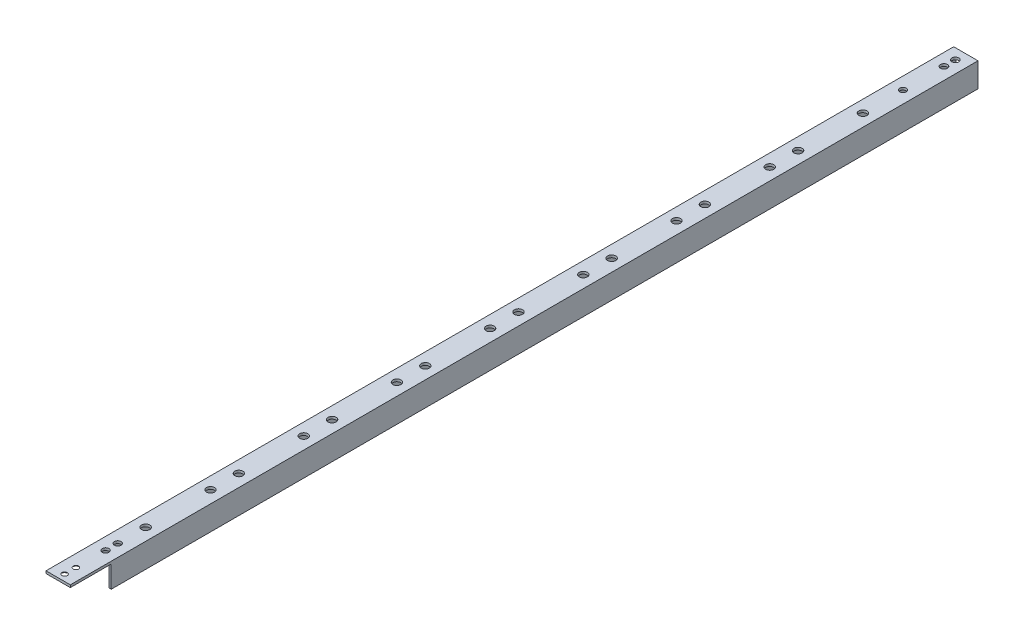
ISO-10303-21;
HEADER;
FILE_DESCRIPTION(('STEP AP214'),'2;1');
FILE_NAME('part.step','',(''),(''),'','','');
FILE_SCHEMA(('AUTOMOTIVE_DESIGN { 1 0 10303 214 1 1 1 1 }'));
ENDSEC;
DATA;
#1=APPLICATION_CONTEXT('core data for automotive mechanical design processes');
#2=APPLICATION_PROTOCOL_DEFINITION('international standard','automotive_design',2000,#1);
#3=PRODUCT_CONTEXT('',#1,'mechanical');
#4=PRODUCT('Part','Part','',(#3));
#5=PRODUCT_RELATED_PRODUCT_CATEGORY('part','',(#4));
#6=PRODUCT_DEFINITION_FORMATION('','',#4);
#7=PRODUCT_DEFINITION_CONTEXT('part definition',#1,'design');
#8=PRODUCT_DEFINITION('design','',#6,#7);
#9=PRODUCT_DEFINITION_SHAPE('','',#8);
#10=(LENGTH_UNIT() NAMED_UNIT(*) SI_UNIT(.MILLI.,.METRE.));
#11=(NAMED_UNIT(*) PLANE_ANGLE_UNIT() SI_UNIT($,.RADIAN.));
#12=(NAMED_UNIT(*) SI_UNIT($,.STERADIAN.) SOLID_ANGLE_UNIT());
#13=UNCERTAINTY_MEASURE_WITH_UNIT(LENGTH_MEASURE(1.E-05),#10,'distance_accuracy_value','');
#14=(GEOMETRIC_REPRESENTATION_CONTEXT(3) GLOBAL_UNCERTAINTY_ASSIGNED_CONTEXT((#13)) GLOBAL_UNIT_ASSIGNED_CONTEXT((#10,
#11,#12)) REPRESENTATION_CONTEXT('',''));
#15=CARTESIAN_POINT('',(0.,0.,0.));
#16=DIRECTION('',(0.,0.,1.));
#17=DIRECTION('',(1.,0.,0.));
#18=AXIS2_PLACEMENT_3D('',#15,#16,#17);
#19=CARTESIAN_POINT('',(-15.,-15.,560.));
#20=DIRECTION('',(0.,1.,0.));
#21=DIRECTION('',(0.,0.,1.));
#22=AXIS2_PLACEMENT_3D('',#19,#20,#21);
#23=PLANE('',#22);
#24=DIRECTION('',(1.,0.,0.));
#25=VECTOR('',#24,1.);
#26=CARTESIAN_POINT('',(0.,-15.,509.5));
#27=LINE('',#26,#25);
#28=CARTESIAN_POINT('',(12.,-15.,509.5));
#29=VERTEX_POINT('',#28);
#30=CARTESIAN_POINT('',(15.,-15.,509.5));
#31=VERTEX_POINT('',#30);
#32=EDGE_CURVE('E144',#29,#31,#27,.T.);
#33=ORIENTED_EDGE('',*,*,#32,.F.);
#34=DIRECTION('',(0.,0.,1.));
#35=VECTOR('',#34,1.);
#36=CARTESIAN_POINT('',(12.,-15.,-560.));
#37=LINE('',#36,#35);
#38=CARTESIAN_POINT('',(12.,-15.,-560.));
#39=VERTEX_POINT('',#38);
#40=EDGE_CURVE('E264',#39,#29,#37,.T.);
#41=ORIENTED_EDGE('',*,*,#40,.F.);
#42=DIRECTION('',(1.,0.,0.));
#43=VECTOR('',#42,1.);
#44=CARTESIAN_POINT('',(-15.,-15.,-560.));
#45=LINE('',#44,#43);
#46=CARTESIAN_POINT('',(15.,-15.,-560.));
#47=VERTEX_POINT('',#46);
#48=EDGE_CURVE('E289',#39,#47,#45,.T.);
#49=ORIENTED_EDGE('',*,*,#48,.T.);
#50=DIRECTION('',(0.,0.,-1.));
#51=VECTOR('',#50,1.);
#52=CARTESIAN_POINT('',(15.,-15.,560.));
#53=LINE('',#52,#51);
#54=EDGE_CURVE('E282',#31,#47,#53,.T.);
#55=ORIENTED_EDGE('',*,*,#54,.F.);
#56=EDGE_LOOP('',(#33,#41,#49,#55));
#57=FACE_BOUND('',#56,.T.);
#58=ADVANCED_FACE('F34',(#57),#23,.F.);
#59=DIRECTION('',(1.,0.,0.));
#60=VECTOR('',#59,1.);
#61=CARTESIAN_POINT('',(0.,-15.,509.5));
#62=LINE('',#61,#60);
#63=CARTESIAN_POINT('',(-15.,-15.,509.5));
#64=VERTEX_POINT('',#63);
#65=CARTESIAN_POINT('',(-12.,-15.,509.5));
#66=VERTEX_POINT('',#65);
#67=EDGE_CURVE('E122',#64,#66,#62,.T.);
#68=ORIENTED_EDGE('',*,*,#67,.F.);
#69=DIRECTION('',(0.,0.,-1.));
#70=VECTOR('',#69,1.);
#71=CARTESIAN_POINT('',(-15.,-15.,560.));
#72=LINE('',#71,#70);
#73=CARTESIAN_POINT('',(-15.,-15.,-560.));
#74=VERTEX_POINT('',#73);
#75=EDGE_CURVE('E131',#64,#74,#72,.T.);
#76=ORIENTED_EDGE('',*,*,#75,.T.);
#77=CARTESIAN_POINT('',(-12.,-15.,-560.));
#78=VERTEX_POINT('',#77);
#79=EDGE_CURVE('E278',#74,#78,#45,.T.);
#80=ORIENTED_EDGE('',*,*,#79,.T.);
#81=DIRECTION('',(0.,0.,1.));
#82=VECTOR('',#81,1.);
#83=CARTESIAN_POINT('',(-12.,-15.,-560.));
#84=LINE('',#83,#82);
#85=EDGE_CURVE('E268',#78,#66,#84,.T.);
#86=ORIENTED_EDGE('',*,*,#85,.T.);
#87=EDGE_LOOP('',(#68,#76,#80,#86));
#88=FACE_BOUND('',#87,.T.);
#89=ADVANCED_FACE('F303',(#88),#23,.F.);
#90=CARTESIAN_POINT('',(12.,-15.,-560.));
#91=DIRECTION('',(1.,0.,0.));
#92=DIRECTION('',(0.,0.,-1.));
#93=AXIS2_PLACEMENT_3D('',#90,#91,#92);
#94=PLANE('',#93);
#95=DIRECTION('',(0.,-1.,0.));
#96=VECTOR('',#95,1.);
#97=CARTESIAN_POINT('',(12.,0.,509.5));
#98=LINE('',#97,#96);
#99=CARTESIAN_POINT('',(12.,12.,509.5));
#100=VERTEX_POINT('',#99);
#101=EDGE_CURVE('E142',#100,#29,#98,.T.);
#102=ORIENTED_EDGE('',*,*,#101,.F.);
#103=DIRECTION('',(0.,0.,1.));
#104=VECTOR('',#103,1.);
#105=CARTESIAN_POINT('',(12.,12.,-560.));
#106=LINE('',#105,#104);
#107=CARTESIAN_POINT('',(12.,12.,-560.));
#108=VERTEX_POINT('',#107);
#109=EDGE_CURVE('E262',#108,#100,#106,.T.);
#110=ORIENTED_EDGE('',*,*,#109,.F.);
#111=DIRECTION('',(0.,1.,0.));
#112=VECTOR('',#111,1.);
#113=CARTESIAN_POINT('',(12.,-15.,-560.));
#114=LINE('',#113,#112);
#115=EDGE_CURVE('E255',#39,#108,#114,.T.);
#116=ORIENTED_EDGE('',*,*,#115,.F.);
#117=ORIENTED_EDGE('',*,*,#40,.T.);
#118=EDGE_LOOP('',(#102,#110,#116,#117));
#119=FACE_BOUND('',#118,.T.);
#120=ADVANCED_FACE('F446',(#119),#94,.F.);
#121=CARTESIAN_POINT('',(-12.,-15.,-560.));
#122=DIRECTION('',(-1.,0.,0.));
#123=DIRECTION('',(0.,0.,1.));
#124=AXIS2_PLACEMENT_3D('',#121,#122,#123);
#125=PLANE('',#124);
#126=DIRECTION('',(0.,1.,0.));
#127=VECTOR('',#126,1.);
#128=CARTESIAN_POINT('',(-12.,0.,509.5));
#129=LINE('',#128,#127);
#130=CARTESIAN_POINT('',(-12.,12.,509.5));
#131=VERTEX_POINT('',#130);
#132=EDGE_CURVE('E49',#66,#131,#129,.T.);
#133=ORIENTED_EDGE('',*,*,#132,.F.);
#134=ORIENTED_EDGE('',*,*,#85,.F.);
#135=DIRECTION('',(0.,-1.,0.));
#136=VECTOR('',#135,1.);
#137=CARTESIAN_POINT('',(-12.,-15.,-560.));
#138=LINE('',#137,#136);
#139=CARTESIAN_POINT('',(-12.,12.,-560.));
#140=VERTEX_POINT('',#139);
#141=EDGE_CURVE('E57',#140,#78,#138,.T.);
#142=ORIENTED_EDGE('',*,*,#141,.F.);
#143=DIRECTION('',(0.,0.,1.));
#144=VECTOR('',#143,1.);
#145=CARTESIAN_POINT('',(-12.,12.,-560.));
#146=LINE('',#145,#144);
#147=EDGE_CURVE('E271',#140,#131,#146,.T.);
#148=ORIENTED_EDGE('',*,*,#147,.T.);
#149=EDGE_LOOP('',(#133,#134,#142,#148));
#150=FACE_BOUND('',#149,.T.);
#151=ADVANCED_FACE('F304',(#150),#125,.F.);
#152=CARTESIAN_POINT('',(-15.,15.,560.));
#153=DIRECTION('',(0.,-1.,0.));
#154=DIRECTION('',(0.,0.,-1.));
#155=AXIS2_PLACEMENT_3D('',#152,#153,#154);
#156=PLANE('',#155);
#157=CARTESIAN_POINT('',(0.,15.,538.));
#158=DIRECTION('',(0.,-1.,0.));
#159=DIRECTION('',(0.,0.,-1.));
#160=AXIS2_PLACEMENT_3D('',#157,#158,#159);
#161=CIRCLE('',#160,3.3);
#162=CARTESIAN_POINT('',(0.,15.,534.7));
#163=VERTEX_POINT('',#162);
#164=EDGE_CURVE('E329',#163,#163,#161,.T.);
#165=ORIENTED_EDGE('',*,*,#164,.T.);
#166=EDGE_LOOP('',(#165));
#167=FACE_BOUND('',#166,.T.);
#168=CARTESIAN_POINT('',(0.,15.,552.));
#169=DIRECTION('',(0.,-1.,0.));
#170=DIRECTION('',(0.,0.,-1.));
#171=AXIS2_PLACEMENT_3D('',#168,#169,#170);
#172=CIRCLE('',#171,3.3);
#173=CARTESIAN_POINT('',(0.,15.,548.7));
#174=VERTEX_POINT('',#173);
#175=EDGE_CURVE('E323',#174,#174,#172,.T.);
#176=ORIENTED_EDGE('',*,*,#175,.T.);
#177=EDGE_LOOP('',(#176));
#178=FACE_BOUND('',#177,.T.);
#179=CARTESIAN_POINT('',(0.,15.,-482.5));
#180=DIRECTION('',(0.,-1.,0.));
#181=DIRECTION('',(0.,0.,-1.));
#182=AXIS2_PLACEMENT_3D('',#179,#180,#181);
#183=CIRCLE('',#182,4.10000000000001);
#184=CARTESIAN_POINT('',(0.,15.,-486.6));
#185=VERTEX_POINT('',#184);
#186=EDGE_CURVE('E315',#185,#185,#183,.T.);
#187=ORIENTED_EDGE('',*,*,#186,.T.);
#188=EDGE_LOOP('',(#187));
#189=FACE_BOUND('',#188,.T.);
#190=CARTESIAN_POINT('',(0.,15.,501.5));
#191=DIRECTION('',(0.,-1.,0.));
#192=DIRECTION('',(0.,0.,-1.));
#193=AXIS2_PLACEMENT_3D('',#190,#191,#192);
#194=CIRCLE('',#193,4.10000000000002);
#195=CARTESIAN_POINT('',(0.,15.,497.4));
#196=VERTEX_POINT('',#195);
#197=EDGE_CURVE('E140',#196,#196,#194,.T.);
#198=ORIENTED_EDGE('',*,*,#197,.T.);
#199=EDGE_LOOP('',(#198));
#200=FACE_BOUND('',#199,.T.);
#201=CARTESIAN_POINT('',(0.,15.,486.5));
#202=DIRECTION('',(0.,-1.,0.));
#203=DIRECTION('',(0.,0.,-1.));
#204=AXIS2_PLACEMENT_3D('',#201,#202,#203);
#205=CIRCLE('',#204,4.09999999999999);
#206=CARTESIAN_POINT('',(0.,15.,482.4));
#207=VERTEX_POINT('',#206);
#208=EDGE_CURVE('E308',#207,#207,#205,.T.);
#209=ORIENTED_EDGE('',*,*,#208,.T.);
#210=EDGE_LOOP('',(#209));
#211=FACE_BOUND('',#210,.T.);
#212=CARTESIAN_POINT('',(0.,15.,-547.));
#213=DIRECTION('',(0.,-1.,0.));
#214=DIRECTION('',(1.,0.,0.));
#215=AXIS2_PLACEMENT_3D('',#212,#213,#214);
#216=CIRCLE('',#215,4.24999999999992);
#217=CARTESIAN_POINT('',(4.24999999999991,15.,-547.));
#218=VERTEX_POINT('',#217);
#219=EDGE_CURVE('E148',#218,#218,#216,.T.);
#220=ORIENTED_EDGE('',*,*,#219,.T.);
#221=EDGE_LOOP('',(#220));
#222=FACE_BOUND('',#221,.T.);
#223=CARTESIAN_POINT('',(0.,15.,-533.));
#224=DIRECTION('',(0.,-1.,0.));
#225=DIRECTION('',(1.,0.,0.));
#226=AXIS2_PLACEMENT_3D('',#223,#224,#225);
#227=CIRCLE('',#226,4.24999999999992);
#228=CARTESIAN_POINT('',(4.24999999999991,15.,-533.));
#229=VERTEX_POINT('',#228);
#230=EDGE_CURVE('E155',#229,#229,#227,.T.);
#231=ORIENTED_EDGE('',*,*,#230,.T.);
#232=EDGE_LOOP('',(#231));
#233=FACE_BOUND('',#232,.T.);
#234=CARTESIAN_POINT('',(0.,15.,107.));
#235=DIRECTION('',(0.,1.,0.));
#236=DIRECTION('',(0.,0.,1.));
#237=AXIS2_PLACEMENT_3D('',#234,#235,#236);
#238=CIRCLE('',#237,4.99999999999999);
#239=CARTESIAN_POINT('',(0.,15.,112.));
#240=VERTEX_POINT('',#239);
#241=EDGE_CURVE('E195',#240,#240,#238,.T.);
#242=ORIENTED_EDGE('',*,*,#241,.F.);
#243=EDGE_LOOP('',(#242));
#244=FACE_BOUND('',#243,.T.);
#245=DIRECTION('',(-1.,0.,0.));
#246=VECTOR('',#245,1.);
#247=CARTESIAN_POINT('',(-15.,15.,-560.));
#248=LINE('',#247,#246);
#249=CARTESIAN_POINT('',(15.,15.,-560.));
#250=VERTEX_POINT('',#249);
#251=CARTESIAN_POINT('',(-15.,15.,-560.));
#252=VERTEX_POINT('',#251);
#253=EDGE_CURVE('E285',#250,#252,#248,.T.);
#254=ORIENTED_EDGE('',*,*,#253,.T.);
#255=DIRECTION('',(0.,0.,-1.));
#256=VECTOR('',#255,1.);
#257=CARTESIAN_POINT('',(-15.,15.,560.));
#258=LINE('',#257,#256);
#259=CARTESIAN_POINT('',(-15.,15.,560.));
#260=VERTEX_POINT('',#259);
#261=EDGE_CURVE('E42',#260,#252,#258,.T.);
#262=ORIENTED_EDGE('',*,*,#261,.F.);
#263=DIRECTION('',(-1.,0.,0.));
#264=VECTOR('',#263,1.);
#265=CARTESIAN_POINT('',(-15.,15.,560.));
#266=LINE('',#265,#264);
#267=CARTESIAN_POINT('',(15.,15.,560.));
#268=VERTEX_POINT('',#267);
#269=EDGE_CURVE('E277',#268,#260,#266,.T.);
#270=ORIENTED_EDGE('',*,*,#269,.F.);
#271=DIRECTION('',(0.,0.,-1.));
#272=VECTOR('',#271,1.);
#273=CARTESIAN_POINT('',(15.,15.,560.));
#274=LINE('',#273,#272);
#275=EDGE_CURVE('E11',#268,#250,#274,.T.);
#276=ORIENTED_EDGE('',*,*,#275,.T.);
#277=EDGE_LOOP('',(#254,#262,#270,#276));
#278=FACE_BOUND('',#277,.T.);
#279=CARTESIAN_POINT('',(0.,15.,-433.));
#280=DIRECTION('',(0.,1.,0.));
#281=DIRECTION('',(0.,0.,1.));
#282=AXIS2_PLACEMENT_3D('',#279,#280,#281);
#283=CIRCLE('',#282,4.99999999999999);
#284=CARTESIAN_POINT('',(0.,15.,-428.));
#285=VERTEX_POINT('',#284);
#286=EDGE_CURVE('E249',#285,#285,#283,.T.);
#287=ORIENTED_EDGE('',*,*,#286,.F.);
#288=EDGE_LOOP('',(#287));
#289=FACE_BOUND('',#288,.T.);
#290=CARTESIAN_POINT('',(0.,15.,-353.));
#291=DIRECTION('',(0.,1.,0.));
#292=DIRECTION('',(0.,0.,1.));
#293=AXIS2_PLACEMENT_3D('',#290,#291,#292);
#294=CIRCLE('',#293,4.99999999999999);
#295=CARTESIAN_POINT('',(0.,15.,-348.));
#296=VERTEX_POINT('',#295);
#297=EDGE_CURVE('E243',#296,#296,#294,.T.);
#298=ORIENTED_EDGE('',*,*,#297,.F.);
#299=EDGE_LOOP('',(#298));
#300=FACE_BOUND('',#299,.T.);
#301=CARTESIAN_POINT('',(0.,15.,-318.));
#302=DIRECTION('',(0.,1.,0.));
#303=DIRECTION('',(0.,0.,1.));
#304=AXIS2_PLACEMENT_3D('',#301,#302,#303);
#305=CIRCLE('',#304,4.99999999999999);
#306=CARTESIAN_POINT('',(0.,15.,-313.));
#307=VERTEX_POINT('',#306);
#308=EDGE_CURVE('E237',#307,#307,#305,.T.);
#309=ORIENTED_EDGE('',*,*,#308,.F.);
#310=EDGE_LOOP('',(#309));
#311=FACE_BOUND('',#310,.T.);
#312=CARTESIAN_POINT('',(0.,15.,-238.));
#313=DIRECTION('',(0.,1.,0.));
#314=DIRECTION('',(0.,0.,1.));
#315=AXIS2_PLACEMENT_3D('',#312,#313,#314);
#316=CIRCLE('',#315,4.99999999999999);
#317=CARTESIAN_POINT('',(0.,15.,-233.));
#318=VERTEX_POINT('',#317);
#319=EDGE_CURVE('E231',#318,#318,#316,.T.);
#320=ORIENTED_EDGE('',*,*,#319,.F.);
#321=EDGE_LOOP('',(#320));
#322=FACE_BOUND('',#321,.T.);
#323=CARTESIAN_POINT('',(0.,15.,-203.));
#324=DIRECTION('',(0.,1.,0.));
#325=DIRECTION('',(0.,0.,1.));
#326=AXIS2_PLACEMENT_3D('',#323,#324,#325);
#327=CIRCLE('',#326,4.99999999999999);
#328=CARTESIAN_POINT('',(0.,15.,-198.));
#329=VERTEX_POINT('',#328);
#330=EDGE_CURVE('E225',#329,#329,#327,.T.);
#331=ORIENTED_EDGE('',*,*,#330,.F.);
#332=EDGE_LOOP('',(#331));
#333=FACE_BOUND('',#332,.T.);
#334=CARTESIAN_POINT('',(0.,15.,-123.));
#335=DIRECTION('',(0.,1.,0.));
#336=DIRECTION('',(0.,0.,1.));
#337=AXIS2_PLACEMENT_3D('',#334,#335,#336);
#338=CIRCLE('',#337,4.99999999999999);
#339=CARTESIAN_POINT('',(0.,15.,-118.));
#340=VERTEX_POINT('',#339);
#341=EDGE_CURVE('E219',#340,#340,#338,.T.);
#342=ORIENTED_EDGE('',*,*,#341,.F.);
#343=EDGE_LOOP('',(#342));
#344=FACE_BOUND('',#343,.T.);
#345=CARTESIAN_POINT('',(0.,15.,-88.));
#346=DIRECTION('',(0.,1.,0.));
#347=DIRECTION('',(0.,0.,1.));
#348=AXIS2_PLACEMENT_3D('',#345,#346,#347);
#349=CIRCLE('',#348,4.99999999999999);
#350=CARTESIAN_POINT('',(0.,15.,-83.));
#351=VERTEX_POINT('',#350);
#352=EDGE_CURVE('E213',#351,#351,#349,.T.);
#353=ORIENTED_EDGE('',*,*,#352,.F.);
#354=EDGE_LOOP('',(#353));
#355=FACE_BOUND('',#354,.T.);
#356=CARTESIAN_POINT('',(0.,15.,-8.));
#357=DIRECTION('',(0.,1.,0.));
#358=DIRECTION('',(0.,0.,1.));
#359=AXIS2_PLACEMENT_3D('',#356,#357,#358);
#360=CIRCLE('',#359,4.99999999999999);
#361=CARTESIAN_POINT('',(0.,15.,-3.00000000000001));
#362=VERTEX_POINT('',#361);
#363=EDGE_CURVE('E207',#362,#362,#360,.T.);
#364=ORIENTED_EDGE('',*,*,#363,.F.);
#365=EDGE_LOOP('',(#364));
#366=FACE_BOUND('',#365,.T.);
#367=CARTESIAN_POINT('',(0.,15.,27.));
#368=DIRECTION('',(0.,1.,0.));
#369=DIRECTION('',(0.,0.,1.));
#370=AXIS2_PLACEMENT_3D('',#367,#368,#369);
#371=CIRCLE('',#370,4.99999999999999);
#372=CARTESIAN_POINT('',(0.,15.,32.));
#373=VERTEX_POINT('',#372);
#374=EDGE_CURVE('E201',#373,#373,#371,.T.);
#375=ORIENTED_EDGE('',*,*,#374,.F.);
#376=EDGE_LOOP('',(#375));
#377=FACE_BOUND('',#376,.T.);
#378=CARTESIAN_POINT('',(0.,15.,142.));
#379=DIRECTION('',(0.,1.,0.));
#380=DIRECTION('',(0.,0.,1.));
#381=AXIS2_PLACEMENT_3D('',#378,#379,#380);
#382=CIRCLE('',#381,4.99999999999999);
#383=CARTESIAN_POINT('',(0.,15.,147.));
#384=VERTEX_POINT('',#383);
#385=EDGE_CURVE('E189',#384,#384,#382,.T.);
#386=ORIENTED_EDGE('',*,*,#385,.F.);
#387=EDGE_LOOP('',(#386));
#388=FACE_BOUND('',#387,.T.);
#389=CARTESIAN_POINT('',(0.,15.,222.));
#390=DIRECTION('',(0.,1.,0.));
#391=DIRECTION('',(0.,0.,1.));
#392=AXIS2_PLACEMENT_3D('',#389,#390,#391);
#393=CIRCLE('',#392,4.99999999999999);
#394=CARTESIAN_POINT('',(0.,15.,227.));
#395=VERTEX_POINT('',#394);
#396=EDGE_CURVE('E183',#395,#395,#393,.T.);
#397=ORIENTED_EDGE('',*,*,#396,.F.);
#398=EDGE_LOOP('',(#397));
#399=FACE_BOUND('',#398,.T.);
#400=CARTESIAN_POINT('',(0.,15.,257.));
#401=DIRECTION('',(0.,1.,0.));
#402=DIRECTION('',(0.,0.,1.));
#403=AXIS2_PLACEMENT_3D('',#400,#401,#402);
#404=CIRCLE('',#403,4.99999999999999);
#405=CARTESIAN_POINT('',(0.,15.,262.));
#406=VERTEX_POINT('',#405);
#407=EDGE_CURVE('E177',#406,#406,#404,.T.);
#408=ORIENTED_EDGE('',*,*,#407,.F.);
#409=EDGE_LOOP('',(#408));
#410=FACE_BOUND('',#409,.T.);
#411=CARTESIAN_POINT('',(0.,15.,337.));
#412=DIRECTION('',(0.,1.,0.));
#413=DIRECTION('',(0.,0.,1.));
#414=AXIS2_PLACEMENT_3D('',#411,#412,#413);
#415=CIRCLE('',#414,4.99999999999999);
#416=CARTESIAN_POINT('',(0.,15.,342.));
#417=VERTEX_POINT('',#416);
#418=EDGE_CURVE('E171',#417,#417,#415,.T.);
#419=ORIENTED_EDGE('',*,*,#418,.F.);
#420=EDGE_LOOP('',(#419));
#421=FACE_BOUND('',#420,.T.);
#422=CARTESIAN_POINT('',(0.,15.,372.));
#423=DIRECTION('',(0.,1.,0.));
#424=DIRECTION('',(0.,0.,1.));
#425=AXIS2_PLACEMENT_3D('',#422,#423,#424);
#426=CIRCLE('',#425,4.99999999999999);
#427=CARTESIAN_POINT('',(0.,15.,377.));
#428=VERTEX_POINT('',#427);
#429=EDGE_CURVE('E165',#428,#428,#426,.T.);
#430=ORIENTED_EDGE('',*,*,#429,.F.);
#431=EDGE_LOOP('',(#430));
#432=FACE_BOUND('',#431,.T.);
#433=CARTESIAN_POINT('',(0.,15.,452.));
#434=DIRECTION('',(0.,1.,0.));
#435=DIRECTION('',(0.,0.,1.));
#436=AXIS2_PLACEMENT_3D('',#433,#434,#435);
#437=CIRCLE('',#436,4.99999999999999);
#438=CARTESIAN_POINT('',(0.,15.,457.));
#439=VERTEX_POINT('',#438);
#440=EDGE_CURVE('E151',#439,#439,#437,.T.);
#441=ORIENTED_EDGE('',*,*,#440,.F.);
#442=EDGE_LOOP('',(#441));
#443=FACE_BOUND('',#442,.T.);
#444=ADVANCED_FACE('F392',(#167,#178,#189,#200,#211,#222,#233,#244,#278,#289,#300,#311,#322,
#333,#344,#355,#366,#377,#388,#399,#410,#421,#432,#443),#156,.F.);
#445=CARTESIAN_POINT('',(15.,-15.,560.));
#446=DIRECTION('',(-1.,0.,0.));
#447=DIRECTION('',(0.,0.,1.));
#448=AXIS2_PLACEMENT_3D('',#445,#446,#447);
#449=PLANE('',#448);
#450=DIRECTION('',(0.,1.,0.));
#451=VECTOR('',#450,1.);
#452=CARTESIAN_POINT('',(15.,-15.,560.));
#453=LINE('',#452,#451);
#454=CARTESIAN_POINT('',(15.,12.,560.));
#455=VERTEX_POINT('',#454);
#456=EDGE_CURVE('E275',#455,#268,#453,.T.);
#457=ORIENTED_EDGE('',*,*,#456,.F.);
#458=DIRECTION('',(0.,0.,1.));
#459=VECTOR('',#458,1.);
#460=CARTESIAN_POINT('',(15.,12.,509.5));
#461=LINE('',#460,#459);
#462=CARTESIAN_POINT('',(15.,12.,509.5));
#463=VERTEX_POINT('',#462);
#464=EDGE_CURVE('E146',#463,#455,#461,.T.);
#465=ORIENTED_EDGE('',*,*,#464,.F.);
#466=DIRECTION('',(0.,1.,0.));
#467=VECTOR('',#466,1.);
#468=CARTESIAN_POINT('',(15.,0.,509.5));
#469=LINE('',#468,#467);
#470=EDGE_CURVE('E136',#31,#463,#469,.T.);
#471=ORIENTED_EDGE('',*,*,#470,.F.);
#472=ORIENTED_EDGE('',*,*,#54,.T.);
#473=DIRECTION('',(0.,1.,0.));
#474=VECTOR('',#473,1.);
#475=CARTESIAN_POINT('',(15.,-15.,-560.));
#476=LINE('',#475,#474);
#477=EDGE_CURVE('E267',#47,#250,#476,.T.);
#478=ORIENTED_EDGE('',*,*,#477,.T.);
#479=ORIENTED_EDGE('',*,*,#275,.F.);
#480=EDGE_LOOP('',(#457,#465,#471,#472,#478,#479));
#481=FACE_BOUND('',#480,.T.);
#482=ADVANCED_FACE('F36',(#481),#449,.F.);
#483=CARTESIAN_POINT('',(-15.,-15.,560.));
#484=DIRECTION('',(1.,0.,0.));
#485=DIRECTION('',(0.,0.,-1.));
#486=AXIS2_PLACEMENT_3D('',#483,#484,#485);
#487=PLANE('',#486);
#488=DIRECTION('',(0.,-1.,0.));
#489=VECTOR('',#488,1.);
#490=CARTESIAN_POINT('',(-15.,0.,509.5));
#491=LINE('',#490,#489);
#492=CARTESIAN_POINT('',(-15.,12.,509.5));
#493=VERTEX_POINT('',#492);
#494=EDGE_CURVE('E125',#493,#64,#491,.T.);
#495=ORIENTED_EDGE('',*,*,#494,.F.);
#496=DIRECTION('',(0.,0.,1.));
#497=VECTOR('',#496,1.);
#498=CARTESIAN_POINT('',(-15.,12.,509.5));
#499=LINE('',#498,#497);
#500=CARTESIAN_POINT('',(-15.,12.,560.));
#501=VERTEX_POINT('',#500);
#502=EDGE_CURVE('E112',#493,#501,#499,.T.);
#503=ORIENTED_EDGE('',*,*,#502,.T.);
#504=DIRECTION('',(0.,-1.,0.));
#505=VECTOR('',#504,1.);
#506=CARTESIAN_POINT('',(-15.,-15.,560.));
#507=LINE('',#506,#505);
#508=EDGE_CURVE('E280',#260,#501,#507,.T.);
#509=ORIENTED_EDGE('',*,*,#508,.F.);
#510=ORIENTED_EDGE('',*,*,#261,.T.);
#511=DIRECTION('',(0.,-1.,0.));
#512=VECTOR('',#511,1.);
#513=CARTESIAN_POINT('',(-15.,-15.,-560.));
#514=LINE('',#513,#512);
#515=EDGE_CURVE('E287',#252,#74,#514,.T.);
#516=ORIENTED_EDGE('',*,*,#515,.T.);
#517=ORIENTED_EDGE('',*,*,#75,.F.);
#518=EDGE_LOOP('',(#495,#503,#509,#510,#516,#517));
#519=FACE_BOUND('',#518,.T.);
#520=ADVANCED_FACE('F129',(#519),#487,.F.);
#521=CARTESIAN_POINT('',(0.,0.,560.));
#522=DIRECTION('',(0.,0.,-1.));
#523=DIRECTION('',(-1.,0.,0.));
#524=AXIS2_PLACEMENT_3D('',#521,#522,#523);
#525=PLANE('',#524);
#526=ORIENTED_EDGE('',*,*,#508,.T.);
#527=DIRECTION('',(-1.,0.,0.));
#528=VECTOR('',#527,1.);
#529=CARTESIAN_POINT('',(12.,12.,560.));
#530=LINE('',#529,#528);
#531=EDGE_CURVE('E116',#455,#501,#530,.T.);
#532=ORIENTED_EDGE('',*,*,#531,.F.);
#533=ORIENTED_EDGE('',*,*,#456,.T.);
#534=ORIENTED_EDGE('',*,*,#269,.T.);
#535=EDGE_LOOP('',(#526,#532,#533,#534));
#536=FACE_BOUND('',#535,.T.);
#537=ADVANCED_FACE('F452',(#536),#525,.F.);
#538=CARTESIAN_POINT('',(0.,0.,-560.));
#539=DIRECTION('',(0.,0.,-1.));
#540=DIRECTION('',(-1.,0.,0.));
#541=AXIS2_PLACEMENT_3D('',#538,#539,#540);
#542=PLANE('',#541);
#543=ORIENTED_EDGE('',*,*,#115,.T.);
#544=DIRECTION('',(-1.,0.,0.));
#545=VECTOR('',#544,1.);
#546=CARTESIAN_POINT('',(12.,12.,-560.));
#547=LINE('',#546,#545);
#548=EDGE_CURVE('E258',#108,#140,#547,.T.);
#549=ORIENTED_EDGE('',*,*,#548,.T.);
#550=ORIENTED_EDGE('',*,*,#141,.T.);
#551=ORIENTED_EDGE('',*,*,#79,.F.);
#552=ORIENTED_EDGE('',*,*,#515,.F.);
#553=ORIENTED_EDGE('',*,*,#253,.F.);
#554=ORIENTED_EDGE('',*,*,#477,.F.);
#555=ORIENTED_EDGE('',*,*,#48,.F.);
#556=EDGE_LOOP('',(#543,#549,#550,#551,#552,#553,#554,#555));
#557=FACE_BOUND('',#556,.T.);
#558=ADVANCED_FACE('F300',(#557),#542,.T.);
#559=CARTESIAN_POINT('',(12.,12.,-560.));
#560=DIRECTION('',(0.,1.,0.));
#561=DIRECTION('',(-1.,0.,0.));
#562=AXIS2_PLACEMENT_3D('',#559,#560,#561);
#563=PLANE('',#562);
#564=CARTESIAN_POINT('',(0.,12.,538.));
#565=DIRECTION('',(0.,-1.,0.));
#566=DIRECTION('',(0.,0.,-1.));
#567=AXIS2_PLACEMENT_3D('',#564,#565,#566);
#568=CIRCLE('',#567,6.3);
#569=CARTESIAN_POINT('',(0.,12.,531.7));
#570=VERTEX_POINT('',#569);
#571=EDGE_CURVE('E332',#570,#570,#568,.T.);
#572=ORIENTED_EDGE('',*,*,#571,.F.);
#573=EDGE_LOOP('',(#572));
#574=FACE_BOUND('',#573,.T.);
#575=CARTESIAN_POINT('',(0.,12.,552.));
#576=DIRECTION('',(0.,-1.,0.));
#577=DIRECTION('',(0.,0.,-1.));
#578=AXIS2_PLACEMENT_3D('',#575,#576,#577);
#579=CIRCLE('',#578,6.3);
#580=CARTESIAN_POINT('',(0.,12.,545.7));
#581=VERTEX_POINT('',#580);
#582=EDGE_CURVE('E326',#581,#581,#579,.T.);
#583=ORIENTED_EDGE('',*,*,#582,.F.);
#584=EDGE_LOOP('',(#583));
#585=FACE_BOUND('',#584,.T.);
#586=CARTESIAN_POINT('',(0.,12.,-482.5));
#587=DIRECTION('',(0.,-1.,0.));
#588=DIRECTION('',(1.,0.,0.));
#589=AXIS2_PLACEMENT_3D('',#586,#587,#588);
#590=CIRCLE('',#589,4.10000000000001);
#591=CARTESIAN_POINT('',(4.10000000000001,12.,-482.5));
#592=VERTEX_POINT('',#591);
#593=EDGE_CURVE('E320',#592,#592,#590,.T.);
#594=ORIENTED_EDGE('',*,*,#593,.F.);
#595=EDGE_LOOP('',(#594));
#596=FACE_BOUND('',#595,.T.);
#597=CARTESIAN_POINT('',(0.,12.,501.5));
#598=DIRECTION('',(0.,-1.,0.));
#599=DIRECTION('',(1.,0.,0.));
#600=AXIS2_PLACEMENT_3D('',#597,#598,#599);
#601=CIRCLE('',#600,4.10000000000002);
#602=CARTESIAN_POINT('',(4.10000000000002,12.,501.5));
#603=VERTEX_POINT('',#602);
#604=EDGE_CURVE('E311',#603,#603,#601,.T.);
#605=ORIENTED_EDGE('',*,*,#604,.F.);
#606=EDGE_LOOP('',(#605));
#607=FACE_BOUND('',#606,.T.);
#608=CARTESIAN_POINT('',(0.,12.,486.5));
#609=DIRECTION('',(0.,-1.,0.));
#610=DIRECTION('',(1.,0.,0.));
#611=AXIS2_PLACEMENT_3D('',#608,#609,#610);
#612=CIRCLE('',#611,4.09999999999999);
#613=CARTESIAN_POINT('',(4.09999999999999,12.,486.5));
#614=VERTEX_POINT('',#613);
#615=EDGE_CURVE('E312',#614,#614,#612,.T.);
#616=ORIENTED_EDGE('',*,*,#615,.F.);
#617=EDGE_LOOP('',(#616));
#618=FACE_BOUND('',#617,.T.);
#619=CARTESIAN_POINT('',(0.,12.,-547.));
#620=DIRECTION('',(0.,-1.,0.));
#621=DIRECTION('',(1.,0.,0.));
#622=AXIS2_PLACEMENT_3D('',#619,#620,#621);
#623=CIRCLE('',#622,4.24999999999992);
#624=CARTESIAN_POINT('',(4.24999999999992,12.,-547.));
#625=VERTEX_POINT('',#624);
#626=EDGE_CURVE('E152',#625,#625,#623,.T.);
#627=ORIENTED_EDGE('',*,*,#626,.F.);
#628=EDGE_LOOP('',(#627));
#629=FACE_BOUND('',#628,.T.);
#630=CARTESIAN_POINT('',(0.,12.,-533.));
#631=DIRECTION('',(0.,-1.,0.));
#632=DIRECTION('',(1.,0.,0.));
#633=AXIS2_PLACEMENT_3D('',#630,#631,#632);
#634=CIRCLE('',#633,4.24999999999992);
#635=CARTESIAN_POINT('',(4.24999999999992,12.,-533.));
#636=VERTEX_POINT('',#635);
#637=EDGE_CURVE('E121',#636,#636,#634,.T.);
#638=ORIENTED_EDGE('',*,*,#637,.F.);
#639=EDGE_LOOP('',(#638));
#640=FACE_BOUND('',#639,.T.);
#641=CARTESIAN_POINT('',(0.,12.,452.));
#642=DIRECTION('',(0.,1.,0.));
#643=DIRECTION('',(-1.,0.,0.));
#644=AXIS2_PLACEMENT_3D('',#641,#642,#643);
#645=CIRCLE('',#644,4.99999999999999);
#646=CARTESIAN_POINT('',(-4.99999999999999,12.,452.));
#647=VERTEX_POINT('',#646);
#648=EDGE_CURVE('E162',#647,#647,#645,.T.);
#649=ORIENTED_EDGE('',*,*,#648,.T.);
#650=EDGE_LOOP('',(#649));
#651=FACE_BOUND('',#650,.T.);
#652=CARTESIAN_POINT('',(0.,12.,372.));
#653=DIRECTION('',(0.,1.,0.));
#654=DIRECTION('',(-1.,0.,0.));
#655=AXIS2_PLACEMENT_3D('',#652,#653,#654);
#656=CIRCLE('',#655,4.99999999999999);
#657=CARTESIAN_POINT('',(-4.99999999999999,12.,372.));
#658=VERTEX_POINT('',#657);
#659=EDGE_CURVE('E168',#658,#658,#656,.T.);
#660=ORIENTED_EDGE('',*,*,#659,.T.);
#661=EDGE_LOOP('',(#660));
#662=FACE_BOUND('',#661,.T.);
#663=CARTESIAN_POINT('',(0.,12.,337.));
#664=DIRECTION('',(0.,1.,0.));
#665=DIRECTION('',(-1.,0.,0.));
#666=AXIS2_PLACEMENT_3D('',#663,#664,#665);
#667=CIRCLE('',#666,4.99999999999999);
#668=CARTESIAN_POINT('',(-4.99999999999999,12.,337.));
#669=VERTEX_POINT('',#668);
#670=EDGE_CURVE('E174',#669,#669,#667,.T.);
#671=ORIENTED_EDGE('',*,*,#670,.T.);
#672=EDGE_LOOP('',(#671));
#673=FACE_BOUND('',#672,.T.);
#674=CARTESIAN_POINT('',(0.,12.,257.));
#675=DIRECTION('',(0.,1.,0.));
#676=DIRECTION('',(-1.,0.,0.));
#677=AXIS2_PLACEMENT_3D('',#674,#675,#676);
#678=CIRCLE('',#677,4.99999999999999);
#679=CARTESIAN_POINT('',(-4.99999999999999,12.,257.));
#680=VERTEX_POINT('',#679);
#681=EDGE_CURVE('E180',#680,#680,#678,.T.);
#682=ORIENTED_EDGE('',*,*,#681,.T.);
#683=EDGE_LOOP('',(#682));
#684=FACE_BOUND('',#683,.T.);
#685=CARTESIAN_POINT('',(0.,12.,222.));
#686=DIRECTION('',(0.,1.,0.));
#687=DIRECTION('',(-1.,0.,0.));
#688=AXIS2_PLACEMENT_3D('',#685,#686,#687);
#689=CIRCLE('',#688,4.99999999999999);
#690=CARTESIAN_POINT('',(-4.99999999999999,12.,222.));
#691=VERTEX_POINT('',#690);
#692=EDGE_CURVE('E186',#691,#691,#689,.T.);
#693=ORIENTED_EDGE('',*,*,#692,.T.);
#694=EDGE_LOOP('',(#693));
#695=FACE_BOUND('',#694,.T.);
#696=CARTESIAN_POINT('',(0.,12.,142.));
#697=DIRECTION('',(0.,1.,0.));
#698=DIRECTION('',(-1.,0.,0.));
#699=AXIS2_PLACEMENT_3D('',#696,#697,#698);
#700=CIRCLE('',#699,4.99999999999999);
#701=CARTESIAN_POINT('',(-4.99999999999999,12.,142.));
#702=VERTEX_POINT('',#701);
#703=EDGE_CURVE('E192',#702,#702,#700,.T.);
#704=ORIENTED_EDGE('',*,*,#703,.T.);
#705=EDGE_LOOP('',(#704));
#706=FACE_BOUND('',#705,.T.);
#707=CARTESIAN_POINT('',(0.,12.,107.));
#708=DIRECTION('',(0.,1.,0.));
#709=DIRECTION('',(-1.,0.,0.));
#710=AXIS2_PLACEMENT_3D('',#707,#708,#709);
#711=CIRCLE('',#710,4.99999999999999);
#712=CARTESIAN_POINT('',(-4.99999999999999,12.,107.));
#713=VERTEX_POINT('',#712);
#714=EDGE_CURVE('E198',#713,#713,#711,.T.);
#715=ORIENTED_EDGE('',*,*,#714,.T.);
#716=EDGE_LOOP('',(#715));
#717=FACE_BOUND('',#716,.T.);
#718=CARTESIAN_POINT('',(0.,12.,27.));
#719=DIRECTION('',(0.,1.,0.));
#720=DIRECTION('',(-1.,0.,0.));
#721=AXIS2_PLACEMENT_3D('',#718,#719,#720);
#722=CIRCLE('',#721,4.99999999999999);
#723=CARTESIAN_POINT('',(-4.99999999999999,12.,27.));
#724=VERTEX_POINT('',#723);
#725=EDGE_CURVE('E204',#724,#724,#722,.T.);
#726=ORIENTED_EDGE('',*,*,#725,.T.);
#727=EDGE_LOOP('',(#726));
#728=FACE_BOUND('',#727,.T.);
#729=CARTESIAN_POINT('',(0.,12.,-8.));
#730=DIRECTION('',(0.,1.,0.));
#731=DIRECTION('',(-1.,0.,0.));
#732=AXIS2_PLACEMENT_3D('',#729,#730,#731);
#733=CIRCLE('',#732,4.99999999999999);
#734=CARTESIAN_POINT('',(-4.99999999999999,12.,-8.));
#735=VERTEX_POINT('',#734);
#736=EDGE_CURVE('E210',#735,#735,#733,.T.);
#737=ORIENTED_EDGE('',*,*,#736,.T.);
#738=EDGE_LOOP('',(#737));
#739=FACE_BOUND('',#738,.T.);
#740=CARTESIAN_POINT('',(0.,12.,-88.));
#741=DIRECTION('',(0.,1.,0.));
#742=DIRECTION('',(-1.,0.,0.));
#743=AXIS2_PLACEMENT_3D('',#740,#741,#742);
#744=CIRCLE('',#743,4.99999999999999);
#745=CARTESIAN_POINT('',(-4.99999999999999,12.,-88.));
#746=VERTEX_POINT('',#745);
#747=EDGE_CURVE('E216',#746,#746,#744,.T.);
#748=ORIENTED_EDGE('',*,*,#747,.T.);
#749=EDGE_LOOP('',(#748));
#750=FACE_BOUND('',#749,.T.);
#751=CARTESIAN_POINT('',(0.,12.,-123.));
#752=DIRECTION('',(0.,1.,0.));
#753=DIRECTION('',(-1.,0.,0.));
#754=AXIS2_PLACEMENT_3D('',#751,#752,#753);
#755=CIRCLE('',#754,4.99999999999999);
#756=CARTESIAN_POINT('',(-4.99999999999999,12.,-123.));
#757=VERTEX_POINT('',#756);
#758=EDGE_CURVE('E222',#757,#757,#755,.T.);
#759=ORIENTED_EDGE('',*,*,#758,.T.);
#760=EDGE_LOOP('',(#759));
#761=FACE_BOUND('',#760,.T.);
#762=CARTESIAN_POINT('',(0.,12.,-203.));
#763=DIRECTION('',(0.,1.,0.));
#764=DIRECTION('',(-1.,0.,0.));
#765=AXIS2_PLACEMENT_3D('',#762,#763,#764);
#766=CIRCLE('',#765,4.99999999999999);
#767=CARTESIAN_POINT('',(-4.99999999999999,12.,-203.));
#768=VERTEX_POINT('',#767);
#769=EDGE_CURVE('E228',#768,#768,#766,.T.);
#770=ORIENTED_EDGE('',*,*,#769,.T.);
#771=EDGE_LOOP('',(#770));
#772=FACE_BOUND('',#771,.T.);
#773=CARTESIAN_POINT('',(0.,12.,-238.));
#774=DIRECTION('',(0.,1.,0.));
#775=DIRECTION('',(-1.,0.,0.));
#776=AXIS2_PLACEMENT_3D('',#773,#774,#775);
#777=CIRCLE('',#776,4.99999999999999);
#778=CARTESIAN_POINT('',(-4.99999999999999,12.,-238.));
#779=VERTEX_POINT('',#778);
#780=EDGE_CURVE('E234',#779,#779,#777,.T.);
#781=ORIENTED_EDGE('',*,*,#780,.T.);
#782=EDGE_LOOP('',(#781));
#783=FACE_BOUND('',#782,.T.);
#784=CARTESIAN_POINT('',(0.,12.,-318.));
#785=DIRECTION('',(0.,1.,0.));
#786=DIRECTION('',(-1.,0.,0.));
#787=AXIS2_PLACEMENT_3D('',#784,#785,#786);
#788=CIRCLE('',#787,4.99999999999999);
#789=CARTESIAN_POINT('',(-4.99999999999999,12.,-318.));
#790=VERTEX_POINT('',#789);
#791=EDGE_CURVE('E240',#790,#790,#788,.T.);
#792=ORIENTED_EDGE('',*,*,#791,.T.);
#793=EDGE_LOOP('',(#792));
#794=FACE_BOUND('',#793,.T.);
#795=CARTESIAN_POINT('',(0.,12.,-353.));
#796=DIRECTION('',(0.,1.,0.));
#797=DIRECTION('',(-1.,0.,0.));
#798=AXIS2_PLACEMENT_3D('',#795,#796,#797);
#799=CIRCLE('',#798,4.99999999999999);
#800=CARTESIAN_POINT('',(-4.99999999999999,12.,-353.));
#801=VERTEX_POINT('',#800);
#802=EDGE_CURVE('E246',#801,#801,#799,.T.);
#803=ORIENTED_EDGE('',*,*,#802,.T.);
#804=EDGE_LOOP('',(#803));
#805=FACE_BOUND('',#804,.T.);
#806=CARTESIAN_POINT('',(0.,12.,-433.));
#807=DIRECTION('',(0.,1.,0.));
#808=DIRECTION('',(-1.,0.,0.));
#809=AXIS2_PLACEMENT_3D('',#806,#807,#808);
#810=CIRCLE('',#809,4.99999999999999);
#811=CARTESIAN_POINT('',(-4.99999999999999,12.,-433.));
#812=VERTEX_POINT('',#811);
#813=EDGE_CURVE('E252',#812,#812,#810,.T.);
#814=ORIENTED_EDGE('',*,*,#813,.T.);
#815=EDGE_LOOP('',(#814));
#816=FACE_BOUND('',#815,.T.);
#817=ORIENTED_EDGE('',*,*,#531,.T.);
#818=ORIENTED_EDGE('',*,*,#502,.F.);
#819=DIRECTION('',(-1.,0.,0.));
#820=VECTOR('',#819,1.);
#821=CARTESIAN_POINT('',(0.,12.,509.5));
#822=LINE('',#821,#820);
#823=EDGE_CURVE('E114',#131,#493,#822,.T.);
#824=ORIENTED_EDGE('',*,*,#823,.F.);
#825=ORIENTED_EDGE('',*,*,#147,.F.);
#826=ORIENTED_EDGE('',*,*,#548,.F.);
#827=ORIENTED_EDGE('',*,*,#109,.T.);
#828=DIRECTION('',(-1.,0.,0.));
#829=VECTOR('',#828,1.);
#830=CARTESIAN_POINT('',(0.,12.,509.5));
#831=LINE('',#830,#829);
#832=EDGE_CURVE('E139',#463,#100,#831,.T.);
#833=ORIENTED_EDGE('',*,*,#832,.F.);
#834=ORIENTED_EDGE('',*,*,#464,.T.);
#835=EDGE_LOOP('',(#817,#818,#824,#825,#826,#827,#833,#834));
#836=FACE_BOUND('',#835,.T.);
#837=ADVANCED_FACE('F113',(#574,#585,#596,#607,#618,#629,#640,#651,#662,#673,#684,#695,#706,
#717,#728,#739,#750,#761,#772,#783,#794,#805,#816,#836),#563,.F.);
#838=CARTESIAN_POINT('',(0.,15.,-433.));
#839=DIRECTION('',(0.,1.,0.));
#840=DIRECTION('',(0.,0.,1.));
#841=AXIS2_PLACEMENT_3D('',#838,#839,#840);
#842=CYLINDRICAL_SURFACE('',#841,4.99999999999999);
#843=ORIENTED_EDGE('',*,*,#813,.F.);
#844=EDGE_LOOP('',(#843));
#845=FACE_BOUND('',#844,.T.);
#846=ORIENTED_EDGE('',*,*,#286,.T.);
#847=EDGE_LOOP('',(#846));
#848=FACE_BOUND('',#847,.T.);
#849=ADVANCED_FACE('F340',(#845,#848),#842,.F.);
#850=CARTESIAN_POINT('',(0.,15.,-353.));
#851=DIRECTION('',(0.,1.,0.));
#852=DIRECTION('',(0.,0.,1.));
#853=AXIS2_PLACEMENT_3D('',#850,#851,#852);
#854=CYLINDRICAL_SURFACE('',#853,4.99999999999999);
#855=ORIENTED_EDGE('',*,*,#802,.F.);
#856=EDGE_LOOP('',(#855));
#857=FACE_BOUND('',#856,.T.);
#858=ORIENTED_EDGE('',*,*,#297,.T.);
#859=EDGE_LOOP('',(#858));
#860=FACE_BOUND('',#859,.T.);
#861=ADVANCED_FACE('F388',(#857,#860),#854,.F.);
#862=CARTESIAN_POINT('',(0.,15.,-318.));
#863=DIRECTION('',(0.,1.,0.));
#864=DIRECTION('',(0.,0.,1.));
#865=AXIS2_PLACEMENT_3D('',#862,#863,#864);
#866=CYLINDRICAL_SURFACE('',#865,4.99999999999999);
#867=ORIENTED_EDGE('',*,*,#791,.F.);
#868=EDGE_LOOP('',(#867));
#869=FACE_BOUND('',#868,.T.);
#870=ORIENTED_EDGE('',*,*,#308,.T.);
#871=EDGE_LOOP('',(#870));
#872=FACE_BOUND('',#871,.T.);
#873=ADVANCED_FACE('F556',(#869,#872),#866,.F.);
#874=CARTESIAN_POINT('',(0.,15.,-238.));
#875=DIRECTION('',(0.,1.,0.));
#876=DIRECTION('',(0.,0.,1.));
#877=AXIS2_PLACEMENT_3D('',#874,#875,#876);
#878=CYLINDRICAL_SURFACE('',#877,4.99999999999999);
#879=ORIENTED_EDGE('',*,*,#780,.F.);
#880=EDGE_LOOP('',(#879));
#881=FACE_BOUND('',#880,.T.);
#882=ORIENTED_EDGE('',*,*,#319,.T.);
#883=EDGE_LOOP('',(#882));
#884=FACE_BOUND('',#883,.T.);
#885=ADVANCED_FACE('F552',(#881,#884),#878,.F.);
#886=CARTESIAN_POINT('',(0.,15.,-203.));
#887=DIRECTION('',(0.,1.,0.));
#888=DIRECTION('',(0.,0.,1.));
#889=AXIS2_PLACEMENT_3D('',#886,#887,#888);
#890=CYLINDRICAL_SURFACE('',#889,4.99999999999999);
#891=ORIENTED_EDGE('',*,*,#769,.F.);
#892=EDGE_LOOP('',(#891));
#893=FACE_BOUND('',#892,.T.);
#894=ORIENTED_EDGE('',*,*,#330,.T.);
#895=EDGE_LOOP('',(#894));
#896=FACE_BOUND('',#895,.T.);
#897=ADVANCED_FACE('F548',(#893,#896),#890,.F.);
#898=CARTESIAN_POINT('',(0.,15.,-123.));
#899=DIRECTION('',(0.,1.,0.));
#900=DIRECTION('',(0.,0.,1.));
#901=AXIS2_PLACEMENT_3D('',#898,#899,#900);
#902=CYLINDRICAL_SURFACE('',#901,4.99999999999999);
#903=ORIENTED_EDGE('',*,*,#758,.F.);
#904=EDGE_LOOP('',(#903));
#905=FACE_BOUND('',#904,.T.);
#906=ORIENTED_EDGE('',*,*,#341,.T.);
#907=EDGE_LOOP('',(#906));
#908=FACE_BOUND('',#907,.T.);
#909=ADVANCED_FACE('F544',(#905,#908),#902,.F.);
#910=CARTESIAN_POINT('',(0.,15.,-88.));
#911=DIRECTION('',(0.,1.,0.));
#912=DIRECTION('',(0.,0.,1.));
#913=AXIS2_PLACEMENT_3D('',#910,#911,#912);
#914=CYLINDRICAL_SURFACE('',#913,4.99999999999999);
#915=ORIENTED_EDGE('',*,*,#747,.F.);
#916=EDGE_LOOP('',(#915));
#917=FACE_BOUND('',#916,.T.);
#918=ORIENTED_EDGE('',*,*,#352,.T.);
#919=EDGE_LOOP('',(#918));
#920=FACE_BOUND('',#919,.T.);
#921=ADVANCED_FACE('F540',(#917,#920),#914,.F.);
#922=CARTESIAN_POINT('',(0.,15.,-8.));
#923=DIRECTION('',(0.,1.,0.));
#924=DIRECTION('',(0.,0.,1.));
#925=AXIS2_PLACEMENT_3D('',#922,#923,#924);
#926=CYLINDRICAL_SURFACE('',#925,4.99999999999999);
#927=ORIENTED_EDGE('',*,*,#736,.F.);
#928=EDGE_LOOP('',(#927));
#929=FACE_BOUND('',#928,.T.);
#930=ORIENTED_EDGE('',*,*,#363,.T.);
#931=EDGE_LOOP('',(#930));
#932=FACE_BOUND('',#931,.T.);
#933=ADVANCED_FACE('F533',(#929,#932),#926,.F.);
#934=CARTESIAN_POINT('',(0.,15.,27.));
#935=DIRECTION('',(0.,1.,0.));
#936=DIRECTION('',(0.,0.,1.));
#937=AXIS2_PLACEMENT_3D('',#934,#935,#936);
#938=CYLINDRICAL_SURFACE('',#937,4.99999999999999);
#939=ORIENTED_EDGE('',*,*,#725,.F.);
#940=EDGE_LOOP('',(#939));
#941=FACE_BOUND('',#940,.T.);
#942=ORIENTED_EDGE('',*,*,#374,.T.);
#943=EDGE_LOOP('',(#942));
#944=FACE_BOUND('',#943,.T.);
#945=ADVANCED_FACE('F523',(#941,#944),#938,.F.);
#946=CARTESIAN_POINT('',(0.,15.,107.));
#947=DIRECTION('',(0.,1.,0.));
#948=DIRECTION('',(0.,0.,1.));
#949=AXIS2_PLACEMENT_3D('',#946,#947,#948);
#950=CYLINDRICAL_SURFACE('',#949,4.99999999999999);
#951=ORIENTED_EDGE('',*,*,#714,.F.);
#952=EDGE_LOOP('',(#951));
#953=FACE_BOUND('',#952,.T.);
#954=ORIENTED_EDGE('',*,*,#241,.T.);
#955=EDGE_LOOP('',(#954));
#956=FACE_BOUND('',#955,.T.);
#957=ADVANCED_FACE('F520',(#953,#956),#950,.F.);
#958=CARTESIAN_POINT('',(0.,15.,142.));
#959=DIRECTION('',(0.,1.,0.));
#960=DIRECTION('',(0.,0.,1.));
#961=AXIS2_PLACEMENT_3D('',#958,#959,#960);
#962=CYLINDRICAL_SURFACE('',#961,4.99999999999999);
#963=ORIENTED_EDGE('',*,*,#703,.F.);
#964=EDGE_LOOP('',(#963));
#965=FACE_BOUND('',#964,.T.);
#966=ORIENTED_EDGE('',*,*,#385,.T.);
#967=EDGE_LOOP('',(#966));
#968=FACE_BOUND('',#967,.T.);
#969=ADVANCED_FACE('F522',(#965,#968),#962,.F.);
#970=CARTESIAN_POINT('',(0.,15.,222.));
#971=DIRECTION('',(0.,1.,0.));
#972=DIRECTION('',(0.,0.,1.));
#973=AXIS2_PLACEMENT_3D('',#970,#971,#972);
#974=CYLINDRICAL_SURFACE('',#973,4.99999999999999);
#975=ORIENTED_EDGE('',*,*,#692,.F.);
#976=EDGE_LOOP('',(#975));
#977=FACE_BOUND('',#976,.T.);
#978=ORIENTED_EDGE('',*,*,#396,.T.);
#979=EDGE_LOOP('',(#978));
#980=FACE_BOUND('',#979,.T.);
#981=ADVANCED_FACE('F530',(#977,#980),#974,.F.);
#982=CARTESIAN_POINT('',(0.,15.,257.));
#983=DIRECTION('',(0.,1.,0.));
#984=DIRECTION('',(0.,0.,1.));
#985=AXIS2_PLACEMENT_3D('',#982,#983,#984);
#986=CYLINDRICAL_SURFACE('',#985,4.99999999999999);
#987=ORIENTED_EDGE('',*,*,#681,.F.);
#988=EDGE_LOOP('',(#987));
#989=FACE_BOUND('',#988,.T.);
#990=ORIENTED_EDGE('',*,*,#407,.T.);
#991=EDGE_LOOP('',(#990));
#992=FACE_BOUND('',#991,.T.);
#993=ADVANCED_FACE('F713',(#989,#992),#986,.F.);
#994=CARTESIAN_POINT('',(0.,15.,337.));
#995=DIRECTION('',(0.,1.,0.));
#996=DIRECTION('',(0.,0.,1.));
#997=AXIS2_PLACEMENT_3D('',#994,#995,#996);
#998=CYLINDRICAL_SURFACE('',#997,4.99999999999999);
#999=ORIENTED_EDGE('',*,*,#670,.F.);
#1000=EDGE_LOOP('',(#999));
#1001=FACE_BOUND('',#1000,.T.);
#1002=ORIENTED_EDGE('',*,*,#418,.T.);
#1003=EDGE_LOOP('',(#1002));
#1004=FACE_BOUND('',#1003,.T.);
#1005=ADVANCED_FACE('F437',(#1001,#1004),#998,.F.);
#1006=CARTESIAN_POINT('',(0.,15.,372.));
#1007=DIRECTION('',(0.,1.,0.));
#1008=DIRECTION('',(0.,0.,1.));
#1009=AXIS2_PLACEMENT_3D('',#1006,#1007,#1008);
#1010=CYLINDRICAL_SURFACE('',#1009,4.99999999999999);
#1011=ORIENTED_EDGE('',*,*,#659,.F.);
#1012=EDGE_LOOP('',(#1011));
#1013=FACE_BOUND('',#1012,.T.);
#1014=ORIENTED_EDGE('',*,*,#429,.T.);
#1015=EDGE_LOOP('',(#1014));
#1016=FACE_BOUND('',#1015,.T.);
#1017=ADVANCED_FACE('F427',(#1013,#1016),#1010,.F.);
#1018=CARTESIAN_POINT('',(0.,15.,452.));
#1019=DIRECTION('',(0.,1.,0.));
#1020=DIRECTION('',(0.,0.,1.));
#1021=AXIS2_PLACEMENT_3D('',#1018,#1019,#1020);
#1022=CYLINDRICAL_SURFACE('',#1021,4.99999999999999);
#1023=ORIENTED_EDGE('',*,*,#648,.F.);
#1024=EDGE_LOOP('',(#1023));
#1025=FACE_BOUND('',#1024,.T.);
#1026=ORIENTED_EDGE('',*,*,#440,.T.);
#1027=EDGE_LOOP('',(#1026));
#1028=FACE_BOUND('',#1027,.T.);
#1029=ADVANCED_FACE('F424',(#1025,#1028),#1022,.F.);
#1030=CARTESIAN_POINT('',(0.,15.,-533.));
#1031=DIRECTION('',(0.,-1.,0.));
#1032=DIRECTION('',(1.,0.,0.));
#1033=AXIS2_PLACEMENT_3D('',#1030,#1031,#1032);
#1034=CYLINDRICAL_SURFACE('',#1033,4.24999999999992);
#1035=ORIENTED_EDGE('',*,*,#230,.F.);
#1036=EDGE_LOOP('',(#1035));
#1037=FACE_BOUND('',#1036,.T.);
#1038=ORIENTED_EDGE('',*,*,#637,.T.);
#1039=EDGE_LOOP('',(#1038));
#1040=FACE_BOUND('',#1039,.T.);
#1041=ADVANCED_FACE('F426',(#1037,#1040),#1034,.F.);
#1042=CARTESIAN_POINT('',(0.,15.,-547.));
#1043=DIRECTION('',(0.,-1.,0.));
#1044=DIRECTION('',(1.,0.,0.));
#1045=AXIS2_PLACEMENT_3D('',#1042,#1043,#1044);
#1046=CYLINDRICAL_SURFACE('',#1045,4.24999999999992);
#1047=ORIENTED_EDGE('',*,*,#219,.F.);
#1048=EDGE_LOOP('',(#1047));
#1049=FACE_BOUND('',#1048,.T.);
#1050=ORIENTED_EDGE('',*,*,#626,.T.);
#1051=EDGE_LOOP('',(#1050));
#1052=FACE_BOUND('',#1051,.T.);
#1053=ADVANCED_FACE('F434',(#1049,#1052),#1046,.F.);
#1054=CARTESIAN_POINT('',(0.,0.,509.5));
#1055=DIRECTION('',(0.,0.,1.));
#1056=DIRECTION('',(1.,0.,0.));
#1057=AXIS2_PLACEMENT_3D('',#1054,#1055,#1056);
#1058=PLANE('',#1057);
#1059=ORIENTED_EDGE('',*,*,#470,.T.);
#1060=ORIENTED_EDGE('',*,*,#832,.T.);
#1061=ORIENTED_EDGE('',*,*,#101,.T.);
#1062=ORIENTED_EDGE('',*,*,#32,.T.);
#1063=EDGE_LOOP('',(#1059,#1060,#1061,#1062));
#1064=FACE_BOUND('',#1063,.T.);
#1065=ADVANCED_FACE('F473',(#1064),#1058,.T.);
#1066=CARTESIAN_POINT('',(0.,0.,509.5));
#1067=DIRECTION('',(0.,0.,1.));
#1068=DIRECTION('',(1.,0.,0.));
#1069=AXIS2_PLACEMENT_3D('',#1066,#1067,#1068);
#1070=PLANE('',#1069);
#1071=ORIENTED_EDGE('',*,*,#132,.T.);
#1072=ORIENTED_EDGE('',*,*,#823,.T.);
#1073=ORIENTED_EDGE('',*,*,#494,.T.);
#1074=ORIENTED_EDGE('',*,*,#67,.T.);
#1075=EDGE_LOOP('',(#1071,#1072,#1073,#1074));
#1076=FACE_BOUND('',#1075,.T.);
#1077=ADVANCED_FACE('F124',(#1076),#1070,.T.);
#1078=CARTESIAN_POINT('',(0.,22.,486.5));
#1079=DIRECTION('',(0.,-1.,0.));
#1080=DIRECTION('',(1.,0.,0.));
#1081=AXIS2_PLACEMENT_3D('',#1078,#1079,#1080);
#1082=CYLINDRICAL_SURFACE('',#1081,4.09999999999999);
#1083=ORIENTED_EDGE('',*,*,#615,.T.);
#1084=EDGE_LOOP('',(#1083));
#1085=FACE_BOUND('',#1084,.T.);
#1086=ORIENTED_EDGE('',*,*,#208,.F.);
#1087=EDGE_LOOP('',(#1086));
#1088=FACE_BOUND('',#1087,.T.);
#1089=ADVANCED_FACE('F480',(#1085,#1088),#1082,.F.);
#1090=CARTESIAN_POINT('',(0.,22.,501.5));
#1091=DIRECTION('',(0.,-1.,0.));
#1092=DIRECTION('',(1.,0.,0.));
#1093=AXIS2_PLACEMENT_3D('',#1090,#1091,#1092);
#1094=CYLINDRICAL_SURFACE('',#1093,4.10000000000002);
#1095=ORIENTED_EDGE('',*,*,#604,.T.);
#1096=EDGE_LOOP('',(#1095));
#1097=FACE_BOUND('',#1096,.T.);
#1098=ORIENTED_EDGE('',*,*,#197,.F.);
#1099=EDGE_LOOP('',(#1098));
#1100=FACE_BOUND('',#1099,.T.);
#1101=ADVANCED_FACE('F487',(#1097,#1100),#1094,.F.);
#1102=CARTESIAN_POINT('',(0.,22.,-482.5));
#1103=DIRECTION('',(0.,-1.,0.));
#1104=DIRECTION('',(1.,0.,0.));
#1105=AXIS2_PLACEMENT_3D('',#1102,#1103,#1104);
#1106=CYLINDRICAL_SURFACE('',#1105,4.10000000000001);
#1107=ORIENTED_EDGE('',*,*,#593,.T.);
#1108=EDGE_LOOP('',(#1107));
#1109=FACE_BOUND('',#1108,.T.);
#1110=ORIENTED_EDGE('',*,*,#186,.F.);
#1111=EDGE_LOOP('',(#1110));
#1112=FACE_BOUND('',#1111,.T.);
#1113=ADVANCED_FACE('F491',(#1109,#1112),#1106,.F.);
#1114=CARTESIAN_POINT('',(0.,12.,552.));
#1115=DIRECTION('',(0.,-1.,0.));
#1116=DIRECTION('',(0.,0.,-1.));
#1117=AXIS2_PLACEMENT_3D('',#1114,#1115,#1116);
#1118=CONICAL_SURFACE('',#1117,6.3,0.785398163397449);
#1119=ORIENTED_EDGE('',*,*,#175,.F.);
#1120=EDGE_LOOP('',(#1119));
#1121=FACE_BOUND('',#1120,.T.);
#1122=ORIENTED_EDGE('',*,*,#582,.T.);
#1123=EDGE_LOOP('',(#1122));
#1124=FACE_BOUND('',#1123,.T.);
#1125=ADVANCED_FACE('F495',(#1121,#1124),#1118,.F.);
#1126=CARTESIAN_POINT('',(0.,12.,538.));
#1127=DIRECTION('',(0.,-1.,0.));
#1128=DIRECTION('',(0.,0.,-1.));
#1129=AXIS2_PLACEMENT_3D('',#1126,#1127,#1128);
#1130=CONICAL_SURFACE('',#1129,6.3,0.785398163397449);
#1131=ORIENTED_EDGE('',*,*,#164,.F.);
#1132=EDGE_LOOP('',(#1131));
#1133=FACE_BOUND('',#1132,.T.);
#1134=ORIENTED_EDGE('',*,*,#571,.T.);
#1135=EDGE_LOOP('',(#1134));
#1136=FACE_BOUND('',#1135,.T.);
#1137=ADVANCED_FACE('F336',(#1133,#1136),#1130,.F.);
#1138=CLOSED_SHELL('',(#58,#89,#120,#151,#444,#482,#520,#537,#558,#837,#849,#861,#873,#885,#897,
#909,#921,#933,#945,#957,#969,#981,#993,#1005,#1017,#1029,#1041,#1053,#1065,#1077,#1089,#1101,
#1113,#1125,#1137));
#1139=MANIFOLD_SOLID_BREP('B2',#1138);
#1140=ADVANCED_BREP_SHAPE_REPRESENTATION('',(#18,#1139),#14);
#1141=SHAPE_DEFINITION_REPRESENTATION(#9,#1140);
ENDSEC;
END-ISO-10303-21;
